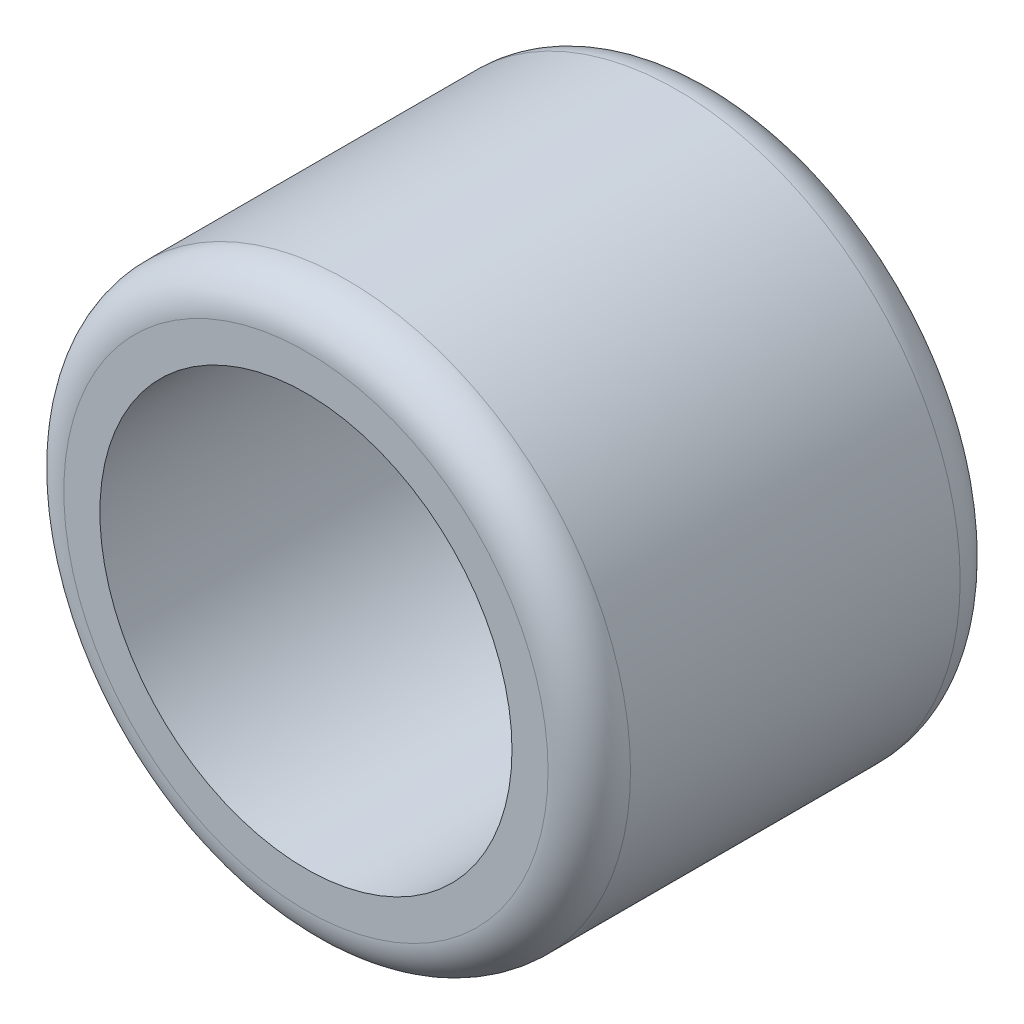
from build123d import *

# Parameters (mm, degrees)
SKETCH1_R           = 8.73125
SKETCH1_R_2         = 6.35
BOSS_EXTRUDE1_DEPTH = 12.7
FILLET1_R           = 1.27


with BuildPart() as part:
    # Sketch1 → Boss-Extrude1 (new body)
    with BuildSketch(Plane.XY):
        Circle(SKETCH1_R)
        Circle(SKETCH1_R_2, mode=Mode.SUBTRACT)
    extrude(amount=BOSS_EXTRUDE1_DEPTH)

    # Fillet1
    fillet1_edges = [part.edges().sort_by_distance(p)[0] for p in [
        (-8.73125, 0, 0),
        (-8.73125, 0, 12.7),
    ]]
    fillet(fillet1_edges, radius=FILLET1_R)


solid = part.part
